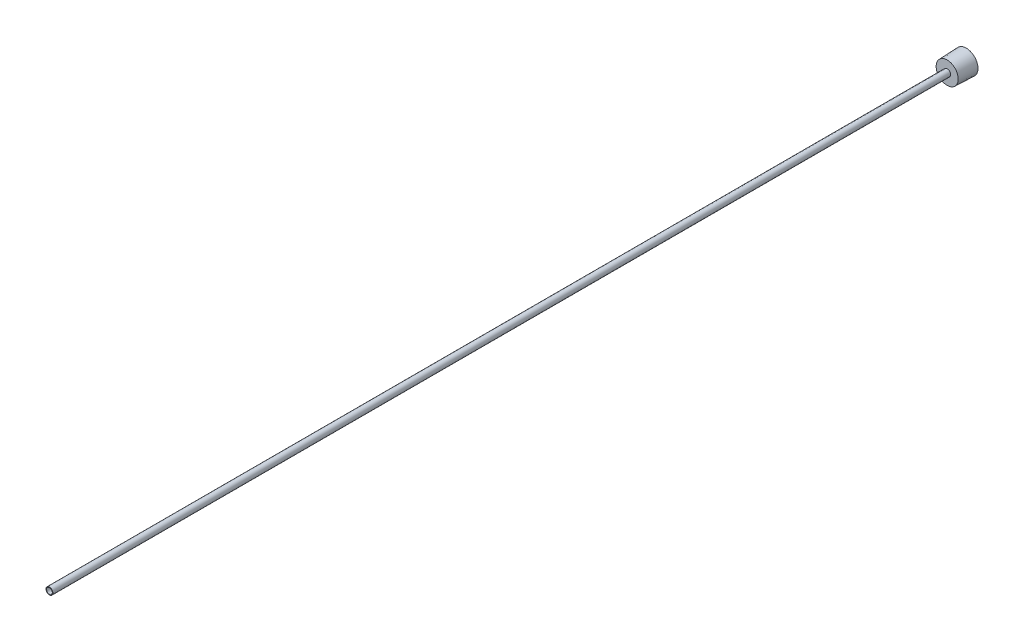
from build123d import *

# Parameters (mm, degrees)
SKETCH2_R          = 0.9652
CUT_EXTRUDE1_DEPTH = 305.84986935
CUT_EXTRUDE2_DEPTH = 3.96875


with BuildPart() as part:
    # Sketch1 → Revolve1 (revolve)
    with BuildSketch(Plane(origin=(0, 0, 0), x_dir=(0, 0, -1), z_dir=(1, 0, 0)), mode=Mode.PRIVATE) as revolve1_sk:
        Polygon((-304.8, 0), (0, 0), (0, 3.8989), (-6.35, 3.667387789), (-6.35, 1.143), (-304.8, 1.143), align=None)
    revolve(revolve1_sk.sketch.rotate(Axis((0, 0, 0), (0, 0, -1)), 90), axis=Axis((0, 0, 0), (0, 0, -1)))

    # Sketch2 → Cut-Extrude1 (cut, through all)
    with BuildSketch(Plane.XY.offset(304.8)):
        Circle(SKETCH2_R)
    extrude(amount=-CUT_EXTRUDE1_DEPTH, mode=Mode.SUBTRACT)

    # Sketch3 → Cut-Extrude2 (cut)
    with BuildSketch(Plane(origin=(0, 0, 0), x_dir=(-1, 0, 0), z_dir=(0, 0, -1))):
        Polygon((0, -2.749630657), (2.38125, -1.374815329), (2.38125, 1.374815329), (0, 2.749630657), (-2.38125, 1.374815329), (-2.38125, -1.374815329), align=None)
    extrude(amount=-CUT_EXTRUDE2_DEPTH, mode=Mode.SUBTRACT)


solid = part.part
